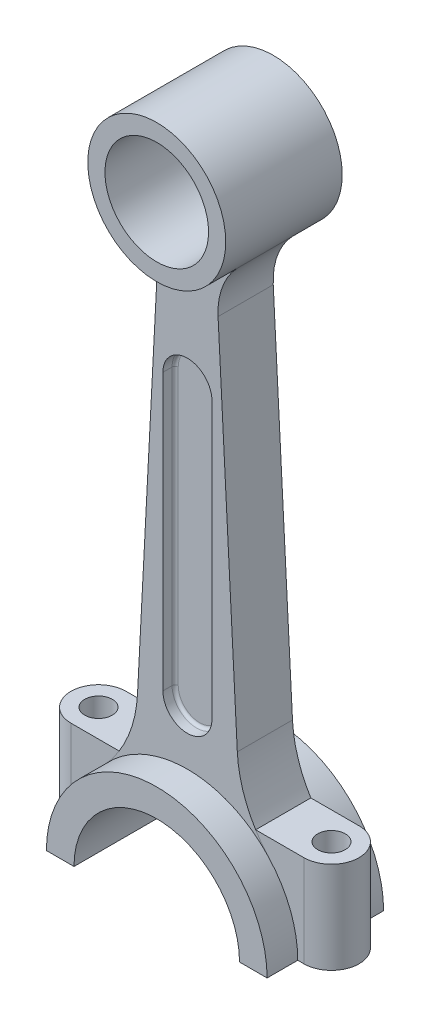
ISO-10303-21;
HEADER;
FILE_DESCRIPTION(('STEP AP214'),'2;1');
FILE_NAME('part.step','',(''),(''),'','','');
FILE_SCHEMA(('AUTOMOTIVE_DESIGN { 1 0 10303 214 1 1 1 1 }'));
ENDSEC;
DATA;
#1=APPLICATION_CONTEXT('core data for automotive mechanical design processes');
#2=APPLICATION_PROTOCOL_DEFINITION('international standard','automotive_design',2000,#1);
#3=PRODUCT_CONTEXT('',#1,'mechanical');
#4=PRODUCT('Part','Part','',(#3));
#5=PRODUCT_RELATED_PRODUCT_CATEGORY('part','',(#4));
#6=PRODUCT_DEFINITION_FORMATION('','',#4);
#7=PRODUCT_DEFINITION_CONTEXT('part definition',#1,'design');
#8=PRODUCT_DEFINITION('design','',#6,#7);
#9=PRODUCT_DEFINITION_SHAPE('','',#8);
#10=(LENGTH_UNIT() NAMED_UNIT(*) SI_UNIT(.MILLI.,.METRE.));
#11=(NAMED_UNIT(*) PLANE_ANGLE_UNIT() SI_UNIT($,.RADIAN.));
#12=(NAMED_UNIT(*) SI_UNIT($,.STERADIAN.) SOLID_ANGLE_UNIT());
#13=UNCERTAINTY_MEASURE_WITH_UNIT(LENGTH_MEASURE(1.E-05),#10,'distance_accuracy_value','');
#14=(GEOMETRIC_REPRESENTATION_CONTEXT(3) GLOBAL_UNCERTAINTY_ASSIGNED_CONTEXT((#13)) GLOBAL_UNIT_ASSIGNED_CONTEXT((#10,
#11,#12)) REPRESENTATION_CONTEXT('',''));
#15=CARTESIAN_POINT('',(0.,0.,0.));
#16=DIRECTION('',(0.,0.,1.));
#17=DIRECTION('',(1.,0.,0.));
#18=AXIS2_PLACEMENT_3D('',#15,#16,#17);
#19=CARTESIAN_POINT('',(-56.2249213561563,-150.065612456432,9.));
#20=DIRECTION('',(0.,0.,-1.));
#21=DIRECTION('',(-1.,0.,0.));
#22=AXIS2_PLACEMENT_3D('',#19,#20,#21);
#23=PLANE('',#22);
#24=CARTESIAN_POINT('',(16.2797399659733,-152.15905070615,8.99815124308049));
#25=CARTESIAN_POINT('',(16.6421278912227,-159.073824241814,8.99815124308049));
#26=CARTESIAN_POINT('',(19.3079660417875,-165.464911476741,8.99815124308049));
#27=CARTESIAN_POINT('',(21.9736081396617,-171.855528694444,8.99815124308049));
#28=CARTESIAN_POINT('',(26.6327739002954,-176.97852402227,8.99815124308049));
#29=B_SPLINE_CURVE_WITH_KNOTS('',2,(#24,#25,#26,#27,#28),.UNSPECIFIED.,.F.,.F.,(3,2,3),(0.,0.5,
1.),.UNSPECIFIED.);
#30=CARTESIAN_POINT('',(22.262894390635,-171.199152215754,8.99951404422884));
#31=VERTEX_POINT('',#30);
#32=CARTESIAN_POINT('',(26.5596134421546,-176.898034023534,8.99911492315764));
#33=VERTEX_POINT('',#32);
#34=EDGE_CURVE('E432',#31,#33,#29,.T.);
#35=ORIENTED_EDGE('',*,*,#34,.F.);
#36=CARTESIAN_POINT('',(56.2249213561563,-150.065612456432,9.));
#37=DIRECTION('',(0.,0.,1.));
#38=DIRECTION('',(1.,0.,0.));
#39=AXIS2_PLACEMENT_3D('',#36,#37,#38);
#40=CIRCLE('',#39,40.);
#41=CARTESIAN_POINT('',(16.2797399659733,-152.15905070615,9.));
#42=VERTEX_POINT('',#41);
#43=EDGE_CURVE('E801',#42,#31,#40,.T.);
#44=ORIENTED_EDGE('',*,*,#43,.F.);
#45=DIRECTION('',(0.0523359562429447,-0.998629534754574,0.));
#46=VECTOR('',#45,1.);
#47=CARTESIAN_POINT('',(10.,-32.3344740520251,9.));
#48=LINE('',#47,#46);
#49=CARTESIAN_POINT('',(10.,-32.3344740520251,9.));
#50=VERTEX_POINT('',#49);
#51=EDGE_CURVE('E802',#50,#42,#48,.T.);
#52=ORIENTED_EDGE('',*,*,#51,.F.);
#53=CARTESIAN_POINT('',(32.4691645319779,-31.1569150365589,9.));
#54=DIRECTION('',(0.,0.,-1.));
#55=DIRECTION('',(-1.,0.,0.));
#56=AXIS2_PLACEMENT_3D('',#53,#54,#55);
#57=CIRCLE('',#56,22.5);
#58=CARTESIAN_POINT('',(16.234582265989,-15.5784575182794,9.));
#59=VERTEX_POINT('',#58);
#60=EDGE_CURVE('E825',#50,#59,#57,.T.);
#61=ORIENTED_EDGE('',*,*,#60,.T.);
#62=CARTESIAN_POINT('',(0.,0.,9.));
#63=DIRECTION('',(0.,0.,1.));
#64=DIRECTION('',(1.,0.,0.));
#65=AXIS2_PLACEMENT_3D('',#62,#63,#64);
#66=CIRCLE('',#65,22.5);
#67=CARTESIAN_POINT('',(-16.234582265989,-15.5784575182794,9.));
#68=VERTEX_POINT('',#67);
#69=EDGE_CURVE('E822',#68,#59,#66,.T.);
#70=ORIENTED_EDGE('',*,*,#69,.F.);
#71=CARTESIAN_POINT('',(-32.4691645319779,-31.1569150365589,9.));
#72=DIRECTION('',(0.,0.,1.));
#73=DIRECTION('',(1.,0.,0.));
#74=AXIS2_PLACEMENT_3D('',#71,#72,#73);
#75=CIRCLE('',#74,22.5);
#76=CARTESIAN_POINT('',(-10.,-32.3344740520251,9.));
#77=VERTEX_POINT('',#76);
#78=EDGE_CURVE('E830',#77,#68,#75,.T.);
#79=ORIENTED_EDGE('',*,*,#78,.F.);
#80=DIRECTION('',(-0.0523359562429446,-0.998629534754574,0.));
#81=VECTOR('',#80,1.);
#82=CARTESIAN_POINT('',(-10.,-32.3344740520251,9.));
#83=LINE('',#82,#81);
#84=CARTESIAN_POINT('',(-16.2797399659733,-152.15905070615,9.));
#85=VERTEX_POINT('',#84);
#86=EDGE_CURVE('E806',#77,#85,#83,.T.);
#87=ORIENTED_EDGE('',*,*,#86,.T.);
#88=CARTESIAN_POINT('',(-56.2249213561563,-150.065612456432,9.));
#89=DIRECTION('',(0.,0.,-1.));
#90=DIRECTION('',(-1.,0.,0.));
#91=AXIS2_PLACEMENT_3D('',#88,#89,#90);
#92=CIRCLE('',#91,40.);
#93=CARTESIAN_POINT('',(-22.2628943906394,-171.199152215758,8.99951404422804));
#94=VERTEX_POINT('',#93);
#95=EDGE_CURVE('E808',#85,#94,#92,.T.);
#96=ORIENTED_EDGE('',*,*,#95,.T.);
#97=CARTESIAN_POINT('',(-22.2633802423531,-171.19884990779,9.));
#98=CARTESIAN_POINT('',(-24.1542025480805,-174.237439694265,9.));
#99=CARTESIAN_POINT('',(-26.5544088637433,-176.892104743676,9.));
#100=B_SPLINE_CURVE_WITH_KNOTS('',2,(#97,#98,#99),.UNSPECIFIED.,.F.,.F.,(3,3),(0.,1.),.UNSPECIFIED.);
#101=CARTESIAN_POINT('',(-26.5542756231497,-176.892226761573,8.9991654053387));
#102=VERTEX_POINT('',#101);
#103=EDGE_CURVE('E724',#94,#102,#100,.T.);
#104=ORIENTED_EDGE('',*,*,#103,.T.);
#105=CARTESIAN_POINT('',(-26.6327739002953,-176.97852402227,9.));
#106=CARTESIAN_POINT('',(-24.102491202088,-174.196346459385,9.));
#107=CARTESIAN_POINT('',(-21.0512266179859,-171.996739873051,9.));
#108=CARTESIAN_POINT('',(-18.0008713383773,-169.797788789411,9.));
#109=CARTESIAN_POINT('',(-14.5605049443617,-168.276205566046,9.));
#110=CARTESIAN_POINT('',(-11.1215103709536,-166.755229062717,9.));
#111=CARTESIAN_POINT('',(-7.44093448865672,-165.977606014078,9.));
#112=CARTESIAN_POINT('',(-3.76182620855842,-165.200293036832,9.));
#113=CARTESIAN_POINT('',(0.,-165.200214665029,9.));
#114=CARTESIAN_POINT('',(3.76032620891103,-165.200136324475,9.));
#115=CARTESIAN_POINT('',(7.44093448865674,-165.977606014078,9.));
#116=CARTESIAN_POINT('',(11.1200751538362,-166.754765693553,9.));
#117=CARTESIAN_POINT('',(14.5605049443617,-168.276205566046,9.));
#118=CARTESIAN_POINT('',(17.9995628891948,-169.79703877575,9.));
#119=CARTESIAN_POINT('',(21.0512266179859,-171.996739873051,9.));
#120=CARTESIAN_POINT('',(24.1019810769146,-174.195785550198,9.));
#121=CARTESIAN_POINT('',(26.6327739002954,-176.97852402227,9.));
#122=B_SPLINE_CURVE_WITH_KNOTS('',2,(#105,#106,#107,#108,#109,#110,#111,#112,#113,#114,#115,
#116,#117,#118,#119,#120,#121),.UNSPECIFIED.,.F.,.F.,(3,2,2,2,2,2,2,2,3),(0.,0.125,0.25,0.375,
0.5,0.625,0.75,0.875,1.),.UNSPECIFIED.);
#123=EDGE_CURVE('E812',#102,#33,#122,.T.);
#124=ORIENTED_EDGE('',*,*,#123,.T.);
#125=EDGE_LOOP('',(#35,#44,#52,#61,#70,#79,#87,#96,#104,#124));
#126=FACE_BOUND('',#125,.T.);
#127=CARTESIAN_POINT('',(0.,-57.0793539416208,9.));
#128=DIRECTION('',(0.,0.,-1.));
#129=DIRECTION('',(-1.,0.,0.));
#130=AXIS2_PLACEMENT_3D('',#127,#128,#129);
#131=CIRCLE('',#130,8.);
#132=CARTESIAN_POINT('',(8.,-57.0793539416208,9.));
#133=VERTEX_POINT('',#132);
#134=CARTESIAN_POINT('',(-8.,-57.0793539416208,9.));
#135=VERTEX_POINT('',#134);
#136=EDGE_CURVE('E284',#133,#135,#131,.F.);
#137=ORIENTED_EDGE('',*,*,#136,.F.);
#138=DIRECTION('',(0.,1.,0.));
#139=VECTOR('',#138,1.);
#140=CARTESIAN_POINT('',(7.99999999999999,-150.065612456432,9.));
#141=LINE('',#140,#139);
#142=CARTESIAN_POINT('',(7.99999999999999,-147.079353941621,9.));
#143=VERTEX_POINT('',#142);
#144=EDGE_CURVE('E375',#143,#133,#141,.T.);
#145=ORIENTED_EDGE('',*,*,#144,.F.);
#146=CARTESIAN_POINT('',(0.,-147.079353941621,9.));
#147=DIRECTION('',(0.,0.,-1.));
#148=DIRECTION('',(-1.,0.,0.));
#149=AXIS2_PLACEMENT_3D('',#146,#147,#148);
#150=CIRCLE('',#149,8.);
#151=CARTESIAN_POINT('',(-8.,-147.079353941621,9.));
#152=VERTEX_POINT('',#151);
#153=EDGE_CURVE('E486',#152,#143,#150,.F.);
#154=ORIENTED_EDGE('',*,*,#153,.F.);
#155=DIRECTION('',(0.,-1.,0.));
#156=VECTOR('',#155,1.);
#157=CARTESIAN_POINT('',(-8.,-150.065612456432,9.));
#158=LINE('',#157,#156);
#159=EDGE_CURVE('E495',#135,#152,#158,.T.);
#160=ORIENTED_EDGE('',*,*,#159,.F.);
#161=EDGE_LOOP('',(#137,#145,#154,#160));
#162=FACE_BOUND('',#161,.T.);
#163=ADVANCED_FACE('F50',(#126,#162),#23,.F.);
#164=CARTESIAN_POINT('',(-20.9981735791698,-202.829751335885,-8.99815124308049));
#165=DIRECTION('',(0.,0.,1.));
#166=DIRECTION('',(1.,0.,0.));
#167=AXIS2_PLACEMENT_3D('',#164,#165,#166);
#168=PLANE('',#167);
#169=DIRECTION('',(1.,0.,0.));
#170=VECTOR('',#169,1.);
#171=CARTESIAN_POINT('',(-20.9981735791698,-201.2,-8.99815124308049));
#172=LINE('',#171,#170);
#173=CARTESIAN_POINT('',(-38.,-201.2,-8.99815124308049));
#174=VERTEX_POINT('',#173);
#175=CARTESIAN_POINT('',(-35.9999783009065,-201.2,-8.99815124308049));
#176=VERTEX_POINT('',#175);
#177=EDGE_CURVE('E526',#174,#176,#172,.T.);
#178=ORIENTED_EDGE('',*,*,#177,.F.);
#179=DIRECTION('',(0.,1.,0.));
#180=VECTOR('',#179,1.);
#181=CARTESIAN_POINT('',(-38.,-202.829751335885,-8.99815124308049));
#182=LINE('',#181,#180);
#183=CARTESIAN_POINT('',(-38.,-171.2,-8.99815124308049));
#184=VERTEX_POINT('',#183);
#185=EDGE_CURVE('E560',#174,#184,#182,.T.);
#186=ORIENTED_EDGE('',*,*,#185,.T.);
#187=DIRECTION('',(1.,0.,0.));
#188=VECTOR('',#187,1.);
#189=CARTESIAN_POINT('',(-20.9981735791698,-171.2,-8.99815124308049));
#190=LINE('',#189,#188);
#191=CARTESIAN_POINT('',(-22.2628943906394,-171.199152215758,-8.99951404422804));
#192=VERTEX_POINT('',#191);
#193=EDGE_CURVE('E559',#184,#192,#190,.T.);
#194=ORIENTED_EDGE('',*,*,#193,.T.);
#195=CARTESIAN_POINT('',(-16.2797399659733,-152.15905070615,-8.99815124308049));
#196=CARTESIAN_POINT('',(-16.6421278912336,-159.073824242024,-8.99815124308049));
#197=CARTESIAN_POINT('',(-19.3079660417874,-165.464911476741,-8.99815124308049));
#198=CARTESIAN_POINT('',(-21.9736081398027,-171.855528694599,-8.99815124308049));
#199=CARTESIAN_POINT('',(-26.6327739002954,-176.97852402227,-8.99815124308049));
#200=B_SPLINE_CURVE_WITH_KNOTS('',2,(#195,#196,#197,#198,#199),.UNSPECIFIED.,.F.,.F.,(3,2,3),
(0.,0.5,1.),.UNSPECIFIED.);
#201=CARTESIAN_POINT('',(-26.559583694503,-176.89806123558,-8.99915367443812));
#202=VERTEX_POINT('',#201);
#203=EDGE_CURVE('E450',#192,#202,#200,.T.);
#204=ORIENTED_EDGE('',*,*,#203,.T.);
#205=CARTESIAN_POINT('',(0.,-201.2,-9.));
#206=DIRECTION('',(0.,0.,-1.));
#207=DIRECTION('',(-0.739803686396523,0.672822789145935,0.));
#208=AXIS2_PLACEMENT_3D('',#205,#206,#207);
#209=CIRCLE('',#208,35.9997853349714);
#210=CARTESIAN_POINT('',(-26.6308913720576,-176.976252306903,-8.99815124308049));
#211=VERTEX_POINT('',#210);
#212=EDGE_CURVE('E625',#211,#202,#209,.T.);
#213=ORIENTED_EDGE('',*,*,#212,.F.);
#214=CARTESIAN_POINT('',(0.,-201.2,-8.99815124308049));
#215=DIRECTION('',(0.,0.,-1.));
#216=DIRECTION('',(-1.,0.,0.));
#217=AXIS2_PLACEMENT_3D('',#214,#215,#216);
#218=CIRCLE('',#217,35.9997853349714);
#219=EDGE_CURVE('E755',#176,#211,#218,.T.);
#220=ORIENTED_EDGE('',*,*,#219,.F.);
#221=EDGE_LOOP('',(#178,#186,#194,#204,#213,#220));
#222=FACE_BOUND('',#221,.T.);
#223=ADVANCED_FACE('F395',(#222),#168,.F.);
#224=CARTESIAN_POINT('',(-38.,-202.829751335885,0.));
#225=DIRECTION('',(0.,1.,0.));
#226=DIRECTION('',(0.,0.,1.));
#227=AXIS2_PLACEMENT_3D('',#224,#225,#226);
#228=CYLINDRICAL_SURFACE('',#227,4.5);
#229=CARTESIAN_POINT('',(-38.,-171.2,0.));
#230=DIRECTION('',(0.,-1.,0.));
#231=DIRECTION('',(0.,0.,1.));
#232=AXIS2_PLACEMENT_3D('',#229,#230,#231);
#233=CIRCLE('',#232,4.5);
#234=CARTESIAN_POINT('',(-38.,-171.2,4.5));
#235=VERTEX_POINT('',#234);
#236=EDGE_CURVE('E549',#235,#235,#233,.T.);
#237=ORIENTED_EDGE('',*,*,#236,.F.);
#238=EDGE_LOOP('',(#237));
#239=FACE_BOUND('',#238,.T.);
#240=CARTESIAN_POINT('',(-38.,-201.2,0.));
#241=DIRECTION('',(0.,-1.,0.));
#242=DIRECTION('',(0.,0.,-1.));
#243=AXIS2_PLACEMENT_3D('',#240,#241,#242);
#244=CIRCLE('',#243,4.5);
#245=CARTESIAN_POINT('',(-38.,-201.2,-4.5));
#246=VERTEX_POINT('',#245);
#247=EDGE_CURVE('E535',#246,#246,#244,.T.);
#248=ORIENTED_EDGE('',*,*,#247,.T.);
#249=EDGE_LOOP('',(#248));
#250=FACE_BOUND('',#249,.T.);
#251=ADVANCED_FACE('F396',(#239,#250),#228,.F.);
#252=CARTESIAN_POINT('',(-38.,-202.829751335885,0.));
#253=DIRECTION('',(0.,1.,0.));
#254=DIRECTION('',(0.,0.,1.));
#255=AXIS2_PLACEMENT_3D('',#252,#253,#254);
#256=CYLINDRICAL_SURFACE('',#255,8.99815124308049);
#257=CARTESIAN_POINT('',(-38.,-201.2,0.));
#258=DIRECTION('',(0.,-1.,0.));
#259=DIRECTION('',(0.,0.,-1.));
#260=AXIS2_PLACEMENT_3D('',#257,#258,#259);
#261=CIRCLE('',#260,8.99815124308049);
#262=CARTESIAN_POINT('',(-38.,-201.2,8.99815124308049));
#263=VERTEX_POINT('',#262);
#264=EDGE_CURVE('E527',#263,#174,#261,.T.);
#265=ORIENTED_EDGE('',*,*,#264,.F.);
#266=DIRECTION('',(0.,1.,0.));
#267=VECTOR('',#266,1.);
#268=CARTESIAN_POINT('',(-38.,-202.829751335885,8.99815124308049));
#269=LINE('',#268,#267);
#270=CARTESIAN_POINT('',(-38.,-171.2,8.99815124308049));
#271=VERTEX_POINT('',#270);
#272=EDGE_CURVE('E554',#263,#271,#269,.T.);
#273=ORIENTED_EDGE('',*,*,#272,.T.);
#274=CARTESIAN_POINT('',(-38.,-171.2,0.));
#275=DIRECTION('',(0.,-1.,0.));
#276=DIRECTION('',(0.,0.,-1.));
#277=AXIS2_PLACEMENT_3D('',#274,#275,#276);
#278=CIRCLE('',#277,8.99815124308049);
#279=EDGE_CURVE('E552',#271,#184,#278,.T.);
#280=ORIENTED_EDGE('',*,*,#279,.T.);
#281=ORIENTED_EDGE('',*,*,#185,.F.);
#282=EDGE_LOOP('',(#265,#273,#280,#281));
#283=FACE_BOUND('',#282,.T.);
#284=ADVANCED_FACE('F780',(#283),#256,.T.);
#285=CARTESIAN_POINT('',(-38.,-202.829751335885,8.99815124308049));
#286=DIRECTION('',(0.,0.,-1.));
#287=DIRECTION('',(-1.,0.,0.));
#288=AXIS2_PLACEMENT_3D('',#285,#286,#287);
#289=PLANE('',#288);
#290=DIRECTION('',(-1.,0.,0.));
#291=VECTOR('',#290,1.);
#292=CARTESIAN_POINT('',(-38.,-201.2,8.99815124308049));
#293=LINE('',#292,#291);
#294=CARTESIAN_POINT('',(-35.9998792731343,-201.200000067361,8.99815124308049));
#295=VERTEX_POINT('',#294);
#296=EDGE_CURVE('E525',#295,#263,#293,.T.);
#297=ORIENTED_EDGE('',*,*,#296,.F.);
#298=CARTESIAN_POINT('',(0.,-201.2,8.99815124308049));
#299=DIRECTION('',(0.,0.,1.));
#300=DIRECTION('',(-0.73980368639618,0.672822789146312,0.));
#301=AXIS2_PLACEMENT_3D('',#298,#299,#300);
#302=CIRCLE('',#301,35.9997853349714);
#303=CARTESIAN_POINT('',(-26.6307844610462,-176.976103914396,8.99815124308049));
#304=VERTEX_POINT('',#303);
#305=EDGE_CURVE('E540',#304,#295,#302,.T.);
#306=ORIENTED_EDGE('',*,*,#305,.F.);
#307=CARTESIAN_POINT('',(-35.9628760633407,-202.829751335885,8.99815124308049));
#308=CARTESIAN_POINT('',(-36.1662621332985,-198.341736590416,8.99815124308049));
#309=CARTESIAN_POINT('',(-35.2602665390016,-193.940651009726,8.99815124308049));
#310=CARTESIAN_POINT('',(-34.3544966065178,-189.540661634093,8.99815124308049));
#311=CARTESIAN_POINT('',(-32.3944093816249,-185.496917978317,8.99815124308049));
#312=CARTESIAN_POINT('',(-30.434976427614,-181.454524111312,8.99815124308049));
#313=CARTESIAN_POINT('',(-27.5411273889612,-178.016582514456,8.99815124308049));
#314=CARTESIAN_POINT('',(-24.6479990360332,-174.579497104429,8.99815124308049));
#315=CARTESIAN_POINT('',(-20.9981735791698,-171.958569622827,8.99815124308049));
#316=B_SPLINE_CURVE_WITH_KNOTS('',2,(#307,#308,#309,#310,#311,#312,#313,#314,#315),
.UNSPECIFIED.,.F.,.F.,(3,2,2,2,3),(0.,0.25,0.5,0.75,1.),.UNSPECIFIED.);
#317=EDGE_CURVE('E807',#304,#102,#316,.T.);
#318=ORIENTED_EDGE('',*,*,#317,.T.);
#319=ORIENTED_EDGE('',*,*,#103,.F.);
#320=DIRECTION('',(-1.,0.,0.));
#321=VECTOR('',#320,1.);
#322=CARTESIAN_POINT('',(-38.,-171.2,8.99815124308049));
#323=LINE('',#322,#321);
#324=EDGE_CURVE('E741',#94,#271,#323,.T.);
#325=ORIENTED_EDGE('',*,*,#324,.T.);
#326=ORIENTED_EDGE('',*,*,#272,.F.);
#327=EDGE_LOOP('',(#297,#306,#318,#319,#325,#326));
#328=FACE_BOUND('',#327,.T.);
#329=ADVANCED_FACE('F767',(#328),#289,.F.);
#330=CARTESIAN_POINT('',(20.9981735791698,-202.829751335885,-8.99815124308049));
#331=DIRECTION('',(0.,0.,1.));
#332=DIRECTION('',(1.,0.,0.));
#333=AXIS2_PLACEMENT_3D('',#330,#331,#332);
#334=PLANE('',#333);
#335=DIRECTION('',(1.,0.,0.));
#336=VECTOR('',#335,1.);
#337=CARTESIAN_POINT('',(20.9981735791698,-201.2,-8.99815124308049));
#338=LINE('',#337,#336);
#339=CARTESIAN_POINT('',(35.9998792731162,-201.200000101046,-8.99815124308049));
#340=VERTEX_POINT('',#339);
#341=CARTESIAN_POINT('',(38.,-201.2,-8.99815124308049));
#342=VERTEX_POINT('',#341);
#343=EDGE_CURVE('E511',#340,#342,#338,.T.);
#344=ORIENTED_EDGE('',*,*,#343,.F.);
#345=CARTESIAN_POINT('',(0.,-201.2,-8.99815124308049));
#346=DIRECTION('',(0.,0.,-1.));
#347=DIRECTION('',(0.73980368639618,0.672822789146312,0.));
#348=AXIS2_PLACEMENT_3D('',#345,#346,#347);
#349=CIRCLE('',#348,35.9997853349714);
#350=CARTESIAN_POINT('',(26.6307844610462,-176.976103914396,-8.99815124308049));
#351=VERTEX_POINT('',#350);
#352=EDGE_CURVE('E796',#351,#340,#349,.T.);
#353=ORIENTED_EDGE('',*,*,#352,.F.);
#354=CARTESIAN_POINT('',(0.,-201.2,-9.));
#355=DIRECTION('',(0.,0.,-1.));
#356=DIRECTION('',(0.737619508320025,0.675216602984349,0.));
#357=AXIS2_PLACEMENT_3D('',#354,#355,#356);
#358=CIRCLE('',#357,35.9997853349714);
#359=CARTESIAN_POINT('',(26.5543100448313,-176.8921952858,-8.99912082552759));
#360=VERTEX_POINT('',#359);
#361=EDGE_CURVE('E630',#360,#351,#358,.T.);
#362=ORIENTED_EDGE('',*,*,#361,.F.);
#363=CARTESIAN_POINT('',(22.26338024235,-171.198849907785,-9.));
#364=CARTESIAN_POINT('',(24.1542025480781,-174.237439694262,-9.));
#365=CARTESIAN_POINT('',(26.554408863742,-176.892104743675,-9.));
#366=B_SPLINE_CURVE_WITH_KNOTS('',2,(#363,#364,#365),.UNSPECIFIED.,.F.,.F.,(3,3),(0.,1.),.UNSPECIFIED.);
#367=CARTESIAN_POINT('',(22.262894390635,-171.199152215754,-8.99951404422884));
#368=VERTEX_POINT('',#367);
#369=EDGE_CURVE('E708',#368,#360,#366,.T.);
#370=ORIENTED_EDGE('',*,*,#369,.F.);
#371=DIRECTION('',(1.,0.,0.));
#372=VECTOR('',#371,1.);
#373=CARTESIAN_POINT('',(20.9981735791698,-171.2,-8.99815124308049));
#374=LINE('',#373,#372);
#375=CARTESIAN_POINT('',(38.,-171.2,-8.99815124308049));
#376=VERTEX_POINT('',#375);
#377=EDGE_CURVE('E726',#368,#376,#374,.T.);
#378=ORIENTED_EDGE('',*,*,#377,.T.);
#379=DIRECTION('',(0.,1.,0.));
#380=VECTOR('',#379,1.);
#381=CARTESIAN_POINT('',(38.,-202.829751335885,-8.99815124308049));
#382=LINE('',#381,#380);
#383=EDGE_CURVE('E543',#342,#376,#382,.T.);
#384=ORIENTED_EDGE('',*,*,#383,.F.);
#385=EDGE_LOOP('',(#344,#353,#362,#370,#378,#384));
#386=FACE_BOUND('',#385,.T.);
#387=ADVANCED_FACE('F582',(#386),#334,.F.);
#388=CARTESIAN_POINT('',(38.,-202.829751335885,0.));
#389=DIRECTION('',(0.,1.,0.));
#390=DIRECTION('',(0.,0.,1.));
#391=AXIS2_PLACEMENT_3D('',#388,#389,#390);
#392=CYLINDRICAL_SURFACE('',#391,4.5);
#393=CARTESIAN_POINT('',(38.,-171.2,0.));
#394=DIRECTION('',(0.,-1.,0.));
#395=DIRECTION('',(0.,0.,-1.));
#396=AXIS2_PLACEMENT_3D('',#393,#394,#395);
#397=CIRCLE('',#396,4.5);
#398=CARTESIAN_POINT('',(38.,-171.2,-4.5));
#399=VERTEX_POINT('',#398);
#400=EDGE_CURVE('E547',#399,#399,#397,.T.);
#401=ORIENTED_EDGE('',*,*,#400,.F.);
#402=EDGE_LOOP('',(#401));
#403=FACE_BOUND('',#402,.T.);
#404=CARTESIAN_POINT('',(38.,-201.2,0.));
#405=DIRECTION('',(0.,-1.,0.));
#406=DIRECTION('',(0.,0.,-1.));
#407=AXIS2_PLACEMENT_3D('',#404,#405,#406);
#408=CIRCLE('',#407,4.5);
#409=CARTESIAN_POINT('',(38.,-201.2,-4.5));
#410=VERTEX_POINT('',#409);
#411=EDGE_CURVE('E512',#410,#410,#408,.T.);
#412=ORIENTED_EDGE('',*,*,#411,.T.);
#413=EDGE_LOOP('',(#412));
#414=FACE_BOUND('',#413,.T.);
#415=ADVANCED_FACE('F1053',(#403,#414),#392,.F.);
#416=CARTESIAN_POINT('',(38.,-202.829751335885,0.));
#417=DIRECTION('',(0.,1.,0.));
#418=DIRECTION('',(0.,0.,1.));
#419=AXIS2_PLACEMENT_3D('',#416,#417,#418);
#420=CYLINDRICAL_SURFACE('',#419,8.99815124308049);
#421=CARTESIAN_POINT('',(38.,-201.2,0.));
#422=DIRECTION('',(0.,-1.,0.));
#423=DIRECTION('',(0.,0.,-1.));
#424=AXIS2_PLACEMENT_3D('',#421,#422,#423);
#425=CIRCLE('',#424,8.99815124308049);
#426=CARTESIAN_POINT('',(38.,-201.2,8.99815124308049));
#427=VERTEX_POINT('',#426);
#428=EDGE_CURVE('E517',#342,#427,#425,.T.);
#429=ORIENTED_EDGE('',*,*,#428,.F.);
#430=ORIENTED_EDGE('',*,*,#383,.T.);
#431=CARTESIAN_POINT('',(38.,-171.2,0.));
#432=DIRECTION('',(0.,-1.,0.));
#433=DIRECTION('',(0.,0.,1.));
#434=AXIS2_PLACEMENT_3D('',#431,#432,#433);
#435=CIRCLE('',#434,8.99815124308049);
#436=CARTESIAN_POINT('',(38.,-171.2,8.99815124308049));
#437=VERTEX_POINT('',#436);
#438=EDGE_CURVE('E541',#376,#437,#435,.T.);
#439=ORIENTED_EDGE('',*,*,#438,.T.);
#440=DIRECTION('',(0.,1.,0.));
#441=VECTOR('',#440,1.);
#442=CARTESIAN_POINT('',(38.,-202.829751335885,8.99815124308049));
#443=LINE('',#442,#441);
#444=EDGE_CURVE('E539',#427,#437,#443,.T.);
#445=ORIENTED_EDGE('',*,*,#444,.F.);
#446=EDGE_LOOP('',(#429,#430,#439,#445));
#447=FACE_BOUND('',#446,.T.);
#448=ADVANCED_FACE('F576',(#447),#420,.T.);
#449=CARTESIAN_POINT('',(38.,-202.829751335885,8.99815124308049));
#450=DIRECTION('',(0.,0.,-1.));
#451=DIRECTION('',(-1.,0.,0.));
#452=AXIS2_PLACEMENT_3D('',#449,#450,#451);
#453=PLANE('',#452);
#454=DIRECTION('',(-1.,0.,0.));
#455=VECTOR('',#454,1.);
#456=CARTESIAN_POINT('',(38.,-201.2,8.99815124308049));
#457=LINE('',#456,#455);
#458=CARTESIAN_POINT('',(35.9998818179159,-201.200000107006,8.99815124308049));
#459=VERTEX_POINT('',#458);
#460=EDGE_CURVE('E518',#427,#459,#457,.T.);
#461=ORIENTED_EDGE('',*,*,#460,.F.);
#462=ORIENTED_EDGE('',*,*,#444,.T.);
#463=DIRECTION('',(-1.,0.,0.));
#464=VECTOR('',#463,1.);
#465=CARTESIAN_POINT('',(38.,-171.2,8.99815124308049));
#466=LINE('',#465,#464);
#467=EDGE_CURVE('E538',#437,#31,#466,.T.);
#468=ORIENTED_EDGE('',*,*,#467,.T.);
#469=ORIENTED_EDGE('',*,*,#34,.T.);
#470=CARTESIAN_POINT('',(20.9981735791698,-171.958569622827,8.99815124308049));
#471=CARTESIAN_POINT('',(24.6473803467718,-174.579052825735,8.99815124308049));
#472=CARTESIAN_POINT('',(27.5411273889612,-178.016582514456,8.99815124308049));
#473=CARTESIAN_POINT('',(30.4341536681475,-181.453255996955,8.99815124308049));
#474=CARTESIAN_POINT('',(32.3944093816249,-185.496917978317,8.99815124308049));
#475=CARTESIAN_POINT('',(34.3540107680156,-189.539230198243,8.99815124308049));
#476=CARTESIAN_POINT('',(35.2602665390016,-193.940651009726,8.99815124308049));
#477=CARTESIAN_POINT('',(36.1662966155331,-198.340975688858,8.99815124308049));
#478=CARTESIAN_POINT('',(35.9628760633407,-202.829751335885,8.99815124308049));
#479=B_SPLINE_CURVE_WITH_KNOTS('',2,(#470,#471,#472,#473,#474,#475,#476,#477,#478),
.UNSPECIFIED.,.F.,.F.,(3,2,2,2,3),(0.,0.25,0.5,0.75,1.),.UNSPECIFIED.);
#480=CARTESIAN_POINT('',(26.6308913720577,-176.976252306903,8.99815124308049));
#481=VERTEX_POINT('',#480);
#482=EDGE_CURVE('E809',#33,#481,#479,.T.);
#483=ORIENTED_EDGE('',*,*,#482,.T.);
#484=CARTESIAN_POINT('',(0.,-201.2,8.99815124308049));
#485=DIRECTION('',(0.,0.,1.));
#486=DIRECTION('',(1.,0.,0.));
#487=AXIS2_PLACEMENT_3D('',#484,#485,#486);
#488=CIRCLE('',#487,35.9997853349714);
#489=EDGE_CURVE('E490',#459,#481,#488,.T.);
#490=ORIENTED_EDGE('',*,*,#489,.F.);
#491=EDGE_LOOP('',(#461,#462,#468,#469,#483,#490));
#492=FACE_BOUND('',#491,.T.);
#493=ADVANCED_FACE('F569',(#492),#453,.F.);
#494=CARTESIAN_POINT('',(-56.2249213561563,-150.065612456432,9.));
#495=DIRECTION('',(0.,0.,-1.));
#496=DIRECTION('',(-1.,0.,0.));
#497=AXIS2_PLACEMENT_3D('',#494,#495,#496);
#498=CYLINDRICAL_SURFACE('',#497,40.);
#499=DIRECTION('',(0.,0.,-1.));
#500=VECTOR('',#499,1.);
#501=CARTESIAN_POINT('',(-22.264095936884,-171.2,9.));
#502=LINE('',#501,#500);
#503=EDGE_CURVE('E595',#94,#192,#502,.T.);
#504=ORIENTED_EDGE('',*,*,#503,.F.);
#505=ORIENTED_EDGE('',*,*,#95,.F.);
#506=DIRECTION('',(0.,0.,-1.));
#507=VECTOR('',#506,1.);
#508=CARTESIAN_POINT('',(-16.2797399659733,-152.15905070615,9.));
#509=LINE('',#508,#507);
#510=CARTESIAN_POINT('',(-16.2797399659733,-152.15905070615,-9.));
#511=VERTEX_POINT('',#510);
#512=EDGE_CURVE('E849',#85,#511,#509,.T.);
#513=ORIENTED_EDGE('',*,*,#512,.T.);
#514=CARTESIAN_POINT('',(-56.2249213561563,-150.065612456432,-9.));
#515=DIRECTION('',(0.,0.,-1.));
#516=DIRECTION('',(-1.,0.,0.));
#517=AXIS2_PLACEMENT_3D('',#514,#515,#516);
#518=CIRCLE('',#517,40.);
#519=EDGE_CURVE('E622',#511,#192,#518,.T.);
#520=ORIENTED_EDGE('',*,*,#519,.T.);
#521=EDGE_LOOP('',(#504,#505,#513,#520));
#522=FACE_BOUND('',#521,.T.);
#523=ADVANCED_FACE('F579',(#522),#498,.F.);
#524=CARTESIAN_POINT('',(-56.2249213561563,-150.065612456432,-9.));
#525=DIRECTION('',(0.,0.,-1.));
#526=DIRECTION('',(-1.,0.,0.));
#527=AXIS2_PLACEMENT_3D('',#524,#525,#526);
#528=PLANE('',#527);
#529=CARTESIAN_POINT('',(0.,-57.0793539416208,-9.));
#530=DIRECTION('',(0.,0.,-1.));
#531=DIRECTION('',(-1.,0.,0.));
#532=AXIS2_PLACEMENT_3D('',#529,#530,#531);
#533=CIRCLE('',#532,8.);
#534=CARTESIAN_POINT('',(-8.,-57.0793539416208,-9.));
#535=VERTEX_POINT('',#534);
#536=CARTESIAN_POINT('',(8.,-57.0793539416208,-9.));
#537=VERTEX_POINT('',#536);
#538=EDGE_CURVE('E289',#535,#537,#533,.T.);
#539=ORIENTED_EDGE('',*,*,#538,.F.);
#540=DIRECTION('',(0.,1.,0.));
#541=VECTOR('',#540,1.);
#542=CARTESIAN_POINT('',(-8.,-150.065612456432,-9.));
#543=LINE('',#542,#541);
#544=CARTESIAN_POINT('',(-8.,-147.079353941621,-9.));
#545=VERTEX_POINT('',#544);
#546=EDGE_CURVE('E275',#545,#535,#543,.T.);
#547=ORIENTED_EDGE('',*,*,#546,.F.);
#548=CARTESIAN_POINT('',(0.,-147.079353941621,-9.));
#549=DIRECTION('',(0.,0.,-1.));
#550=DIRECTION('',(-1.,0.,0.));
#551=AXIS2_PLACEMENT_3D('',#548,#549,#550);
#552=CIRCLE('',#551,8.);
#553=CARTESIAN_POINT('',(8.,-147.079353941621,-9.));
#554=VERTEX_POINT('',#553);
#555=EDGE_CURVE('E281',#554,#545,#552,.T.);
#556=ORIENTED_EDGE('',*,*,#555,.F.);
#557=DIRECTION('',(0.,-1.,0.));
#558=VECTOR('',#557,1.);
#559=CARTESIAN_POINT('',(7.99999999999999,-150.065612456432,-9.));
#560=LINE('',#559,#558);
#561=EDGE_CURVE('E300',#537,#554,#560,.T.);
#562=ORIENTED_EDGE('',*,*,#561,.F.);
#563=EDGE_LOOP('',(#539,#547,#556,#562));
#564=FACE_BOUND('',#563,.T.);
#565=ORIENTED_EDGE('',*,*,#369,.T.);
#566=CARTESIAN_POINT('',(0.,-201.2,-9.));
#567=DIRECTION('',(0.,0.,-1.));
#568=DIRECTION('',(-0.737767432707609,0.675054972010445,0.));
#569=AXIS2_PLACEMENT_3D('',#566,#567,#568);
#570=CIRCLE('',#569,35.9997853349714);
#571=EDGE_CURVE('E641',#202,#360,#570,.T.);
#572=ORIENTED_EDGE('',*,*,#571,.F.);
#573=ORIENTED_EDGE('',*,*,#203,.F.);
#574=ORIENTED_EDGE('',*,*,#519,.F.);
#575=DIRECTION('',(-0.0523359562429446,-0.998629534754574,0.));
#576=VECTOR('',#575,1.);
#577=CARTESIAN_POINT('',(-10.,-32.3344740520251,-9.));
#578=LINE('',#577,#576);
#579=CARTESIAN_POINT('',(-10.,-32.3344740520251,-9.));
#580=VERTEX_POINT('',#579);
#581=EDGE_CURVE('E461',#580,#511,#578,.T.);
#582=ORIENTED_EDGE('',*,*,#581,.F.);
#583=CARTESIAN_POINT('',(-32.4691645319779,-31.1569150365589,-9.));
#584=DIRECTION('',(0.,0.,1.));
#585=DIRECTION('',(1.,0.,0.));
#586=AXIS2_PLACEMENT_3D('',#583,#584,#585);
#587=CIRCLE('',#586,22.5);
#588=CARTESIAN_POINT('',(-16.234582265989,-15.5784575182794,-9.));
#589=VERTEX_POINT('',#588);
#590=EDGE_CURVE('E811',#580,#589,#587,.T.);
#591=ORIENTED_EDGE('',*,*,#590,.T.);
#592=CARTESIAN_POINT('',(0.,0.,-9.));
#593=DIRECTION('',(0.,0.,1.));
#594=DIRECTION('',(1.,0.,0.));
#595=AXIS2_PLACEMENT_3D('',#592,#593,#594);
#596=CIRCLE('',#595,22.5);
#597=CARTESIAN_POINT('',(16.234582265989,-15.5784575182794,-9.));
#598=VERTEX_POINT('',#597);
#599=EDGE_CURVE('E820',#589,#598,#596,.T.);
#600=ORIENTED_EDGE('',*,*,#599,.T.);
#601=CARTESIAN_POINT('',(32.4691645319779,-31.1569150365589,-9.));
#602=DIRECTION('',(0.,0.,-1.));
#603=DIRECTION('',(-1.,0.,0.));
#604=AXIS2_PLACEMENT_3D('',#601,#602,#603);
#605=CIRCLE('',#604,22.5);
#606=CARTESIAN_POINT('',(10.,-32.3344740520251,-9.));
#607=VERTEX_POINT('',#606);
#608=EDGE_CURVE('E833',#607,#598,#605,.T.);
#609=ORIENTED_EDGE('',*,*,#608,.F.);
#610=DIRECTION('',(0.0523359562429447,-0.998629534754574,0.));
#611=VECTOR('',#610,1.);
#612=CARTESIAN_POINT('',(10.,-32.3344740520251,-9.));
#613=LINE('',#612,#611);
#614=CARTESIAN_POINT('',(16.2797399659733,-152.15905070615,-9.));
#615=VERTEX_POINT('',#614);
#616=EDGE_CURVE('E623',#607,#615,#613,.T.);
#617=ORIENTED_EDGE('',*,*,#616,.T.);
#618=CARTESIAN_POINT('',(56.2249213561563,-150.065612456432,-9.));
#619=DIRECTION('',(0.,0.,1.));
#620=DIRECTION('',(1.,0.,0.));
#621=AXIS2_PLACEMENT_3D('',#618,#619,#620);
#622=CIRCLE('',#621,40.);
#623=EDGE_CURVE('E616',#615,#368,#622,.T.);
#624=ORIENTED_EDGE('',*,*,#623,.T.);
#625=EDGE_LOOP('',(#565,#572,#573,#574,#582,#591,#600,#609,#617,#624));
#626=FACE_BOUND('',#625,.T.);
#627=ADVANCED_FACE('F294',(#564,#626),#528,.T.);
#628=CARTESIAN_POINT('',(0.,-201.2,19.));
#629=DIRECTION('',(0.,0.,-1.));
#630=DIRECTION('',(-1.,0.,0.));
#631=AXIS2_PLACEMENT_3D('',#628,#629,#630);
#632=CYLINDRICAL_SURFACE('',#631,35.9997853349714);
#633=DIRECTION('',(0.,0.,-1.));
#634=VECTOR('',#633,1.);
#635=CARTESIAN_POINT('',(35.9997853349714,-201.2,19.));
#636=LINE('',#635,#634);
#637=CARTESIAN_POINT('',(35.9997853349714,-201.2,19.));
#638=VERTEX_POINT('',#637);
#639=EDGE_CURVE('E467',#638,#459,#636,.T.);
#640=ORIENTED_EDGE('',*,*,#639,.T.);
#641=ORIENTED_EDGE('',*,*,#489,.T.);
#642=ORIENTED_EDGE('',*,*,#482,.F.);
#643=ORIENTED_EDGE('',*,*,#123,.F.);
#644=ORIENTED_EDGE('',*,*,#317,.F.);
#645=ORIENTED_EDGE('',*,*,#305,.T.);
#646=DIRECTION('',(0.,0.,-1.));
#647=VECTOR('',#646,1.);
#648=CARTESIAN_POINT('',(-35.9997853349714,-201.2,19.));
#649=LINE('',#648,#647);
#650=CARTESIAN_POINT('',(-35.9997853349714,-201.2,19.));
#651=VERTEX_POINT('',#650);
#652=EDGE_CURVE('E615',#651,#295,#649,.T.);
#653=ORIENTED_EDGE('',*,*,#652,.F.);
#654=CARTESIAN_POINT('',(0.,-201.2,19.));
#655=DIRECTION('',(0.,0.,1.));
#656=DIRECTION('',(-1.,0.,0.));
#657=AXIS2_PLACEMENT_3D('',#654,#655,#656);
#658=CIRCLE('',#657,35.9997853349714);
#659=EDGE_CURVE('E470',#638,#651,#658,.T.);
#660=ORIENTED_EDGE('',*,*,#659,.F.);
#661=EDGE_LOOP('',(#640,#641,#642,#643,#644,#645,#653,#660));
#662=FACE_BOUND('',#661,.T.);
#663=ADVANCED_FACE('F664',(#662),#632,.T.);
#664=ORIENTED_EDGE('',*,*,#361,.T.);
#665=ORIENTED_EDGE('',*,*,#352,.T.);
#666=CARTESIAN_POINT('',(35.9997853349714,-201.2,-19.));
#667=VERTEX_POINT('',#666);
#668=EDGE_CURVE('E611',#340,#667,#636,.T.);
#669=ORIENTED_EDGE('',*,*,#668,.T.);
#670=CARTESIAN_POINT('',(0.,-201.2,-19.));
#671=DIRECTION('',(0.,0.,1.));
#672=DIRECTION('',(-1.,0.,0.));
#673=AXIS2_PLACEMENT_3D('',#670,#671,#672);
#674=CIRCLE('',#673,35.9997853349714);
#675=CARTESIAN_POINT('',(-35.9997853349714,-201.2,-19.));
#676=VERTEX_POINT('',#675);
#677=EDGE_CURVE('E471',#667,#676,#674,.T.);
#678=ORIENTED_EDGE('',*,*,#677,.T.);
#679=EDGE_CURVE('E474',#176,#676,#649,.T.);
#680=ORIENTED_EDGE('',*,*,#679,.F.);
#681=ORIENTED_EDGE('',*,*,#219,.T.);
#682=ORIENTED_EDGE('',*,*,#212,.T.);
#683=ORIENTED_EDGE('',*,*,#571,.T.);
#684=EDGE_LOOP('',(#664,#665,#669,#678,#680,#681,#682,#683));
#685=FACE_BOUND('',#684,.T.);
#686=ADVANCED_FACE('F671',(#685),#632,.T.);
#687=CARTESIAN_POINT('',(0.,0.,19.));
#688=DIRECTION('',(0.,0.,-1.));
#689=DIRECTION('',(-1.,0.,0.));
#690=AXIS2_PLACEMENT_3D('',#687,#688,#689);
#691=CYLINDRICAL_SURFACE('',#690,22.5);
#692=CARTESIAN_POINT('',(0.,0.,-19.));
#693=DIRECTION('',(0.,0.,1.));
#694=DIRECTION('',(1.,0.,0.));
#695=AXIS2_PLACEMENT_3D('',#692,#693,#694);
#696=CIRCLE('',#695,22.5);
#697=CARTESIAN_POINT('',(22.5,0.,-19.));
#698=VERTEX_POINT('',#697);
#699=EDGE_CURVE('E857',#698,#698,#696,.T.);
#700=ORIENTED_EDGE('',*,*,#699,.T.);
#701=EDGE_LOOP('',(#700));
#702=FACE_BOUND('',#701,.T.);
#703=CARTESIAN_POINT('',(0.,0.,19.));
#704=DIRECTION('',(0.,0.,1.));
#705=DIRECTION('',(1.,0.,0.));
#706=AXIS2_PLACEMENT_3D('',#703,#704,#705);
#707=CIRCLE('',#706,22.5);
#708=CARTESIAN_POINT('',(22.5,0.,19.));
#709=VERTEX_POINT('',#708);
#710=EDGE_CURVE('E859',#709,#709,#707,.T.);
#711=ORIENTED_EDGE('',*,*,#710,.F.);
#712=EDGE_LOOP('',(#711));
#713=FACE_BOUND('',#712,.T.);
#714=DIRECTION('',(0.,0.,-1.));
#715=VECTOR('',#714,1.);
#716=CARTESIAN_POINT('',(-16.234582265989,-15.5784575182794,9.));
#717=LINE('',#716,#715);
#718=EDGE_CURVE('E836',#68,#589,#717,.T.);
#719=ORIENTED_EDGE('',*,*,#718,.F.);
#720=ORIENTED_EDGE('',*,*,#69,.T.);
#721=DIRECTION('',(0.,0.,-1.));
#722=VECTOR('',#721,1.);
#723=CARTESIAN_POINT('',(16.234582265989,-15.5784575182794,9.));
#724=LINE('',#723,#722);
#725=EDGE_CURVE('E845',#59,#598,#724,.T.);
#726=ORIENTED_EDGE('',*,*,#725,.T.);
#727=ORIENTED_EDGE('',*,*,#599,.F.);
#728=EDGE_LOOP('',(#719,#720,#726,#727));
#729=FACE_BOUND('',#728,.T.);
#730=ADVANCED_FACE('F861',(#702,#713,#729),#691,.T.);
#731=CARTESIAN_POINT('',(0.,0.,19.));
#732=DIRECTION('',(0.,0.,1.));
#733=DIRECTION('',(1.,0.,0.));
#734=AXIS2_PLACEMENT_3D('',#731,#732,#733);
#735=PLANE('',#734);
#736=ORIENTED_EDGE('',*,*,#710,.T.);
#737=EDGE_LOOP('',(#736));
#738=FACE_BOUND('',#737,.T.);
#739=CARTESIAN_POINT('',(0.,0.,19.));
#740=DIRECTION('',(0.,0.,1.));
#741=DIRECTION('',(1.,0.,0.));
#742=AXIS2_PLACEMENT_3D('',#739,#740,#741);
#743=CIRCLE('',#742,16.9);
#744=CARTESIAN_POINT('',(16.9,0.,19.));
#745=VERTEX_POINT('',#744);
#746=EDGE_CURVE('E853',#745,#745,#743,.T.);
#747=ORIENTED_EDGE('',*,*,#746,.F.);
#748=EDGE_LOOP('',(#747));
#749=FACE_BOUND('',#748,.T.);
#750=ADVANCED_FACE('F872',(#738,#749),#735,.T.);
#751=CARTESIAN_POINT('',(0.,0.,-19.));
#752=DIRECTION('',(0.,0.,1.));
#753=DIRECTION('',(1.,0.,0.));
#754=AXIS2_PLACEMENT_3D('',#751,#752,#753);
#755=PLANE('',#754);
#756=ORIENTED_EDGE('',*,*,#699,.F.);
#757=EDGE_LOOP('',(#756));
#758=FACE_BOUND('',#757,.T.);
#759=CARTESIAN_POINT('',(0.,0.,-19.));
#760=DIRECTION('',(0.,0.,1.));
#761=DIRECTION('',(1.,0.,0.));
#762=AXIS2_PLACEMENT_3D('',#759,#760,#761);
#763=CIRCLE('',#762,16.9);
#764=CARTESIAN_POINT('',(16.9,0.,-19.));
#765=VERTEX_POINT('',#764);
#766=EDGE_CURVE('E855',#765,#765,#763,.T.);
#767=ORIENTED_EDGE('',*,*,#766,.T.);
#768=EDGE_LOOP('',(#767));
#769=FACE_BOUND('',#768,.T.);
#770=ADVANCED_FACE('F870',(#758,#769),#755,.F.);
#771=CARTESIAN_POINT('',(0.,0.,19.));
#772=DIRECTION('',(0.,0.,-1.));
#773=DIRECTION('',(-1.,0.,0.));
#774=AXIS2_PLACEMENT_3D('',#771,#772,#773);
#775=CYLINDRICAL_SURFACE('',#774,16.9);
#776=ORIENTED_EDGE('',*,*,#746,.T.);
#777=EDGE_LOOP('',(#776));
#778=FACE_BOUND('',#777,.T.);
#779=ORIENTED_EDGE('',*,*,#766,.F.);
#780=EDGE_LOOP('',(#779));
#781=FACE_BOUND('',#780,.T.);
#782=ADVANCED_FACE('F867',(#778,#781),#775,.F.);
#783=CARTESIAN_POINT('',(-10.,-32.3344740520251,9.));
#784=DIRECTION('',(0.998629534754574,-0.0523359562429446,0.));
#785=DIRECTION('',(0.0523359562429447,0.998629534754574,0.));
#786=AXIS2_PLACEMENT_3D('',#783,#784,#785);
#787=PLANE('',#786);
#788=ORIENTED_EDGE('',*,*,#581,.T.);
#789=ORIENTED_EDGE('',*,*,#512,.F.);
#790=ORIENTED_EDGE('',*,*,#86,.F.);
#791=DIRECTION('',(0.,0.,-1.));
#792=VECTOR('',#791,1.);
#793=CARTESIAN_POINT('',(-10.,-32.3344740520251,9.));
#794=LINE('',#793,#792);
#795=EDGE_CURVE('E829',#77,#580,#794,.T.);
#796=ORIENTED_EDGE('',*,*,#795,.T.);
#797=EDGE_LOOP('',(#788,#789,#790,#796));
#798=FACE_BOUND('',#797,.T.);
#799=ADVANCED_FACE('F878',(#798),#787,.F.);
#800=CARTESIAN_POINT('',(56.2249213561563,-150.065612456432,9.));
#801=DIRECTION('',(0.,0.,-1.));
#802=DIRECTION('',(-1.,0.,0.));
#803=AXIS2_PLACEMENT_3D('',#800,#801,#802);
#804=CYLINDRICAL_SURFACE('',#803,40.);
#805=DIRECTION('',(0.,0.,-1.));
#806=VECTOR('',#805,1.);
#807=CARTESIAN_POINT('',(22.2640959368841,-171.2,9.));
#808=LINE('',#807,#806);
#809=EDGE_CURVE('E482',#368,#31,#808,.F.);
#810=ORIENTED_EDGE('',*,*,#809,.F.);
#811=ORIENTED_EDGE('',*,*,#623,.F.);
#812=DIRECTION('',(0.,0.,-1.));
#813=VECTOR('',#812,1.);
#814=CARTESIAN_POINT('',(16.2797399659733,-152.15905070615,9.));
#815=LINE('',#814,#813);
#816=EDGE_CURVE('E850',#42,#615,#815,.T.);
#817=ORIENTED_EDGE('',*,*,#816,.F.);
#818=ORIENTED_EDGE('',*,*,#43,.T.);
#819=EDGE_LOOP('',(#810,#811,#817,#818));
#820=FACE_BOUND('',#819,.T.);
#821=ADVANCED_FACE('F881',(#820),#804,.F.);
#822=CARTESIAN_POINT('',(10.,-32.3344740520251,9.));
#823=DIRECTION('',(0.998629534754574,0.0523359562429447,0.));
#824=DIRECTION('',(-0.0523359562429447,0.998629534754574,0.));
#825=AXIS2_PLACEMENT_3D('',#822,#823,#824);
#826=PLANE('',#825);
#827=ORIENTED_EDGE('',*,*,#616,.F.);
#828=DIRECTION('',(0.,0.,-1.));
#829=VECTOR('',#828,1.);
#830=CARTESIAN_POINT('',(10.,-32.3344740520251,9.));
#831=LINE('',#830,#829);
#832=EDGE_CURVE('E843',#50,#607,#831,.T.);
#833=ORIENTED_EDGE('',*,*,#832,.F.);
#834=ORIENTED_EDGE('',*,*,#51,.T.);
#835=ORIENTED_EDGE('',*,*,#816,.T.);
#836=EDGE_LOOP('',(#827,#833,#834,#835));
#837=FACE_BOUND('',#836,.T.);
#838=ADVANCED_FACE('F1219',(#837),#826,.T.);
#839=CARTESIAN_POINT('',(32.4691645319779,-31.1569150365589,9.));
#840=DIRECTION('',(0.,0.,-1.));
#841=DIRECTION('',(-1.,0.,0.));
#842=AXIS2_PLACEMENT_3D('',#839,#840,#841);
#843=CYLINDRICAL_SURFACE('',#842,22.5);
#844=ORIENTED_EDGE('',*,*,#608,.T.);
#845=ORIENTED_EDGE('',*,*,#725,.F.);
#846=ORIENTED_EDGE('',*,*,#60,.F.);
#847=ORIENTED_EDGE('',*,*,#832,.T.);
#848=EDGE_LOOP('',(#844,#845,#846,#847));
#849=FACE_BOUND('',#848,.T.);
#850=ADVANCED_FACE('F1236',(#849),#843,.F.);
#851=CARTESIAN_POINT('',(-32.4691645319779,-31.1569150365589,9.));
#852=DIRECTION('',(0.,0.,-1.));
#853=DIRECTION('',(-1.,0.,0.));
#854=AXIS2_PLACEMENT_3D('',#851,#852,#853);
#855=CYLINDRICAL_SURFACE('',#854,22.5);
#856=ORIENTED_EDGE('',*,*,#590,.F.);
#857=ORIENTED_EDGE('',*,*,#795,.F.);
#858=ORIENTED_EDGE('',*,*,#78,.T.);
#859=ORIENTED_EDGE('',*,*,#718,.T.);
#860=EDGE_LOOP('',(#856,#857,#858,#859));
#861=FACE_BOUND('',#860,.T.);
#862=ADVANCED_FACE('F1246',(#861),#855,.F.);
#863=CARTESIAN_POINT('',(0.,-201.2,19.));
#864=DIRECTION('',(0.,0.,-1.));
#865=DIRECTION('',(-1.,0.,0.));
#866=AXIS2_PLACEMENT_3D('',#863,#864,#865);
#867=CYLINDRICAL_SURFACE('',#866,26.9999476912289);
#868=CARTESIAN_POINT('',(0.,-201.2,-19.));
#869=DIRECTION('',(0.,0.,-1.));
#870=DIRECTION('',(-1.,0.,0.));
#871=AXIS2_PLACEMENT_3D('',#868,#869,#870);
#872=CIRCLE('',#871,26.9999476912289);
#873=CARTESIAN_POINT('',(-26.9999476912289,-201.2,-19.));
#874=VERTEX_POINT('',#873);
#875=CARTESIAN_POINT('',(26.9999476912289,-201.2,-19.));
#876=VERTEX_POINT('',#875);
#877=EDGE_CURVE('E476',#874,#876,#872,.T.);
#878=ORIENTED_EDGE('',*,*,#877,.T.);
#879=DIRECTION('',(0.,0.,-1.));
#880=VECTOR('',#879,1.);
#881=CARTESIAN_POINT('',(26.9999476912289,-201.2,19.));
#882=LINE('',#881,#880);
#883=CARTESIAN_POINT('',(26.9999476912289,-201.2,19.));
#884=VERTEX_POINT('',#883);
#885=EDGE_CURVE('E465',#884,#876,#882,.T.);
#886=ORIENTED_EDGE('',*,*,#885,.F.);
#887=CARTESIAN_POINT('',(0.,-201.2,19.));
#888=DIRECTION('',(0.,0.,-1.));
#889=DIRECTION('',(-1.,0.,0.));
#890=AXIS2_PLACEMENT_3D('',#887,#888,#889);
#891=CIRCLE('',#890,26.9999476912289);
#892=CARTESIAN_POINT('',(-26.9999476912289,-201.2,19.));
#893=VERTEX_POINT('',#892);
#894=EDGE_CURVE('E455',#893,#884,#891,.T.);
#895=ORIENTED_EDGE('',*,*,#894,.F.);
#896=DIRECTION('',(0.,0.,-1.));
#897=VECTOR('',#896,1.);
#898=CARTESIAN_POINT('',(-26.9999476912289,-201.2,19.));
#899=LINE('',#898,#897);
#900=EDGE_CURVE('E468',#893,#874,#899,.T.);
#901=ORIENTED_EDGE('',*,*,#900,.T.);
#902=EDGE_LOOP('',(#878,#886,#895,#901));
#903=FACE_BOUND('',#902,.T.);
#904=ADVANCED_FACE('F409',(#903),#867,.F.);
#905=CARTESIAN_POINT('',(26.9999476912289,-201.2,19.));
#906=DIRECTION('',(0.,1.,0.));
#907=DIRECTION('',(0.,0.,1.));
#908=AXIS2_PLACEMENT_3D('',#905,#906,#907);
#909=PLANE('',#908);
#910=ORIENTED_EDGE('',*,*,#411,.F.);
#911=EDGE_LOOP('',(#910));
#912=FACE_BOUND('',#911,.T.);
#913=DIRECTION('',(1.,0.,0.));
#914=VECTOR('',#913,1.);
#915=CARTESIAN_POINT('',(26.9999476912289,-201.2,-19.));
#916=LINE('',#915,#914);
#917=EDGE_CURVE('E480',#876,#667,#916,.T.);
#918=ORIENTED_EDGE('',*,*,#917,.T.);
#919=ORIENTED_EDGE('',*,*,#668,.F.);
#920=ORIENTED_EDGE('',*,*,#343,.T.);
#921=ORIENTED_EDGE('',*,*,#428,.T.);
#922=ORIENTED_EDGE('',*,*,#460,.T.);
#923=ORIENTED_EDGE('',*,*,#639,.F.);
#924=DIRECTION('',(-1.,0.,0.));
#925=VECTOR('',#924,1.);
#926=CARTESIAN_POINT('',(0.,-201.2,19.));
#927=LINE('',#926,#925);
#928=EDGE_CURVE('E457',#884,#638,#927,.F.);
#929=ORIENTED_EDGE('',*,*,#928,.F.);
#930=ORIENTED_EDGE('',*,*,#885,.T.);
#931=EDGE_LOOP('',(#918,#919,#920,#921,#922,#923,#929,#930));
#932=FACE_BOUND('',#931,.T.);
#933=ADVANCED_FACE('F677',(#912,#932),#909,.F.);
#934=CARTESIAN_POINT('',(-35.9997853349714,-201.2,19.));
#935=DIRECTION('',(0.,1.,0.));
#936=DIRECTION('',(0.,0.,1.));
#937=AXIS2_PLACEMENT_3D('',#934,#935,#936);
#938=PLANE('',#937);
#939=ORIENTED_EDGE('',*,*,#247,.F.);
#940=EDGE_LOOP('',(#939));
#941=FACE_BOUND('',#940,.T.);
#942=DIRECTION('',(1.,0.,0.));
#943=VECTOR('',#942,1.);
#944=CARTESIAN_POINT('',(-35.9997853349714,-201.2,-19.));
#945=LINE('',#944,#943);
#946=EDGE_CURVE('E462',#676,#874,#945,.T.);
#947=ORIENTED_EDGE('',*,*,#946,.T.);
#948=ORIENTED_EDGE('',*,*,#900,.F.);
#949=DIRECTION('',(-1.,0.,0.));
#950=VECTOR('',#949,1.);
#951=CARTESIAN_POINT('',(0.,-201.2,19.));
#952=LINE('',#951,#950);
#953=EDGE_CURVE('E469',#651,#893,#952,.F.);
#954=ORIENTED_EDGE('',*,*,#953,.F.);
#955=ORIENTED_EDGE('',*,*,#652,.T.);
#956=ORIENTED_EDGE('',*,*,#296,.T.);
#957=ORIENTED_EDGE('',*,*,#264,.T.);
#958=ORIENTED_EDGE('',*,*,#177,.T.);
#959=ORIENTED_EDGE('',*,*,#679,.T.);
#960=EDGE_LOOP('',(#947,#948,#954,#955,#956,#957,#958,#959));
#961=FACE_BOUND('',#960,.T.);
#962=ADVANCED_FACE('F674',(#941,#961),#938,.F.);
#963=CARTESIAN_POINT('',(0.,-201.2,19.));
#964=DIRECTION('',(0.,0.,-1.));
#965=DIRECTION('',(-1.,0.,0.));
#966=AXIS2_PLACEMENT_3D('',#963,#964,#965);
#967=PLANE('',#966);
#968=ORIENTED_EDGE('',*,*,#894,.T.);
#969=ORIENTED_EDGE('',*,*,#928,.T.);
#970=ORIENTED_EDGE('',*,*,#659,.T.);
#971=ORIENTED_EDGE('',*,*,#953,.T.);
#972=EDGE_LOOP('',(#968,#969,#970,#971));
#973=FACE_BOUND('',#972,.T.);
#974=ADVANCED_FACE('F1280',(#973),#967,.F.);
#975=CARTESIAN_POINT('',(0.,-201.2,-19.));
#976=DIRECTION('',(0.,0.,-1.));
#977=DIRECTION('',(-1.,0.,0.));
#978=AXIS2_PLACEMENT_3D('',#975,#976,#977);
#979=PLANE('',#978);
#980=ORIENTED_EDGE('',*,*,#877,.F.);
#981=ORIENTED_EDGE('',*,*,#946,.F.);
#982=ORIENTED_EDGE('',*,*,#677,.F.);
#983=ORIENTED_EDGE('',*,*,#917,.F.);
#984=EDGE_LOOP('',(#980,#981,#982,#983));
#985=FACE_BOUND('',#984,.T.);
#986=ADVANCED_FACE('F1034',(#985),#979,.T.);
#987=CARTESIAN_POINT('',(-38.,-171.2,0.));
#988=DIRECTION('',(0.,-1.,0.));
#989=DIRECTION('',(0.,0.,-1.));
#990=AXIS2_PLACEMENT_3D('',#987,#988,#989);
#991=PLANE('',#990);
#992=ORIENTED_EDGE('',*,*,#236,.T.);
#993=EDGE_LOOP('',(#992));
#994=FACE_BOUND('',#993,.T.);
#995=ORIENTED_EDGE('',*,*,#324,.F.);
#996=ORIENTED_EDGE('',*,*,#503,.T.);
#997=ORIENTED_EDGE('',*,*,#193,.F.);
#998=ORIENTED_EDGE('',*,*,#279,.F.);
#999=EDGE_LOOP('',(#995,#996,#997,#998));
#1000=FACE_BOUND('',#999,.T.);
#1001=ADVANCED_FACE('F1028',(#994,#1000),#991,.F.);
#1002=CARTESIAN_POINT('',(38.,-171.2,0.));
#1003=DIRECTION('',(0.,1.,0.));
#1004=DIRECTION('',(0.,0.,1.));
#1005=AXIS2_PLACEMENT_3D('',#1002,#1003,#1004);
#1006=PLANE('',#1005);
#1007=ORIENTED_EDGE('',*,*,#377,.F.);
#1008=ORIENTED_EDGE('',*,*,#809,.T.);
#1009=ORIENTED_EDGE('',*,*,#467,.F.);
#1010=ORIENTED_EDGE('',*,*,#438,.F.);
#1011=EDGE_LOOP('',(#1007,#1008,#1009,#1010));
#1012=FACE_BOUND('',#1011,.T.);
#1013=ORIENTED_EDGE('',*,*,#400,.T.);
#1014=EDGE_LOOP('',(#1013));
#1015=FACE_BOUND('',#1014,.T.);
#1016=ADVANCED_FACE('F996',(#1012,#1015),#1006,.T.);
#1017=CARTESIAN_POINT('',(0.,-57.0793539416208,19.000025));
#1018=DIRECTION('',(0.,0.,-1.));
#1019=DIRECTION('',(-1.,0.,0.));
#1020=AXIS2_PLACEMENT_3D('',#1017,#1018,#1019);
#1021=CYLINDRICAL_SURFACE('',#1020,8.);
#1022=DIRECTION('',(0.,0.,-1.));
#1023=VECTOR('',#1022,1.);
#1024=CARTESIAN_POINT('',(-8.,-57.0793539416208,19.000025));
#1025=LINE('',#1024,#1023);
#1026=CARTESIAN_POINT('',(-8.,-57.0793539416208,6.));
#1027=VERTEX_POINT('',#1026);
#1028=EDGE_CURVE('E370',#135,#1027,#1025,.T.);
#1029=ORIENTED_EDGE('',*,*,#1028,.T.);
#1030=CARTESIAN_POINT('',(0.,-57.0793539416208,6.));
#1031=DIRECTION('',(0.,0.,1.));
#1032=DIRECTION('',(1.,0.,0.));
#1033=AXIS2_PLACEMENT_3D('',#1030,#1031,#1032);
#1034=CIRCLE('',#1033,8.);
#1035=CARTESIAN_POINT('',(8.,-57.0793539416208,6.));
#1036=VERTEX_POINT('',#1035);
#1037=EDGE_CURVE('E11',#1027,#1036,#1034,.F.);
#1038=ORIENTED_EDGE('',*,*,#1037,.T.);
#1039=DIRECTION('',(0.,0.,-1.));
#1040=VECTOR('',#1039,1.);
#1041=CARTESIAN_POINT('',(8.,-57.0793539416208,19.000025));
#1042=LINE('',#1041,#1040);
#1043=EDGE_CURVE('E362',#133,#1036,#1042,.T.);
#1044=ORIENTED_EDGE('',*,*,#1043,.F.);
#1045=ORIENTED_EDGE('',*,*,#136,.T.);
#1046=EDGE_LOOP('',(#1029,#1038,#1044,#1045));
#1047=FACE_BOUND('',#1046,.T.);
#1048=ADVANCED_FACE('F364',(#1047),#1021,.F.);
#1049=CARTESIAN_POINT('',(-8.,-57.0793539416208,19.000025));
#1050=DIRECTION('',(1.,0.,0.));
#1051=DIRECTION('',(0.,0.,-1.));
#1052=AXIS2_PLACEMENT_3D('',#1049,#1050,#1051);
#1053=PLANE('',#1052);
#1054=DIRECTION('',(0.,0.,-1.));
#1055=VECTOR('',#1054,1.);
#1056=CARTESIAN_POINT('',(-8.,-147.079353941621,19.000025));
#1057=LINE('',#1056,#1055);
#1058=CARTESIAN_POINT('',(-8.,-147.079353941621,6.));
#1059=VERTEX_POINT('',#1058);
#1060=EDGE_CURVE('E507',#152,#1059,#1057,.T.);
#1061=ORIENTED_EDGE('',*,*,#1060,.T.);
#1062=DIRECTION('',(0.,-1.,0.));
#1063=VECTOR('',#1062,1.);
#1064=CARTESIAN_POINT('',(-8.,-57.0793539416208,6.));
#1065=LINE('',#1064,#1063);
#1066=EDGE_CURVE('E61',#1059,#1027,#1065,.F.);
#1067=ORIENTED_EDGE('',*,*,#1066,.T.);
#1068=ORIENTED_EDGE('',*,*,#1028,.F.);
#1069=ORIENTED_EDGE('',*,*,#159,.T.);
#1070=EDGE_LOOP('',(#1061,#1067,#1068,#1069));
#1071=FACE_BOUND('',#1070,.T.);
#1072=ADVANCED_FACE('F985',(#1071),#1053,.T.);
#1073=CARTESIAN_POINT('',(0.,-147.079353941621,19.000025));
#1074=DIRECTION('',(0.,0.,-1.));
#1075=DIRECTION('',(-1.,0.,0.));
#1076=AXIS2_PLACEMENT_3D('',#1073,#1074,#1075);
#1077=CYLINDRICAL_SURFACE('',#1076,8.);
#1078=DIRECTION('',(0.,0.,-1.));
#1079=VECTOR('',#1078,1.);
#1080=CARTESIAN_POINT('',(8.,-147.079353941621,19.000025));
#1081=LINE('',#1080,#1079);
#1082=CARTESIAN_POINT('',(8.,-147.079353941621,6.));
#1083=VERTEX_POINT('',#1082);
#1084=EDGE_CURVE('E373',#143,#1083,#1081,.T.);
#1085=ORIENTED_EDGE('',*,*,#1084,.T.);
#1086=CARTESIAN_POINT('',(0.,-147.079353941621,6.));
#1087=DIRECTION('',(0.,0.,1.));
#1088=DIRECTION('',(1.,0.,0.));
#1089=AXIS2_PLACEMENT_3D('',#1086,#1087,#1088);
#1090=CIRCLE('',#1089,8.);
#1091=EDGE_CURVE('E75',#1083,#1059,#1090,.F.);
#1092=ORIENTED_EDGE('',*,*,#1091,.T.);
#1093=ORIENTED_EDGE('',*,*,#1060,.F.);
#1094=ORIENTED_EDGE('',*,*,#153,.T.);
#1095=EDGE_LOOP('',(#1085,#1092,#1093,#1094));
#1096=FACE_BOUND('',#1095,.T.);
#1097=ADVANCED_FACE('F386',(#1096),#1077,.F.);
#1098=CARTESIAN_POINT('',(8.,-57.0793539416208,19.000025));
#1099=DIRECTION('',(-1.,0.,0.));
#1100=DIRECTION('',(0.,0.,1.));
#1101=AXIS2_PLACEMENT_3D('',#1098,#1099,#1100);
#1102=PLANE('',#1101);
#1103=ORIENTED_EDGE('',*,*,#1043,.T.);
#1104=DIRECTION('',(0.,1.,0.));
#1105=VECTOR('',#1104,1.);
#1106=CARTESIAN_POINT('',(8.,-147.079353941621,6.));
#1107=LINE('',#1106,#1105);
#1108=EDGE_CURVE('E330',#1036,#1083,#1107,.F.);
#1109=ORIENTED_EDGE('',*,*,#1108,.T.);
#1110=ORIENTED_EDGE('',*,*,#1084,.F.);
#1111=ORIENTED_EDGE('',*,*,#144,.T.);
#1112=EDGE_LOOP('',(#1103,#1109,#1110,#1111));
#1113=FACE_BOUND('',#1112,.T.);
#1114=ADVANCED_FACE('F369',(#1113),#1102,.T.);
#1115=CARTESIAN_POINT('',(0.,-57.0793539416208,5.));
#1116=DIRECTION('',(0.,0.,1.));
#1117=DIRECTION('',(1.,0.,0.));
#1118=AXIS2_PLACEMENT_3D('',#1115,#1116,#1117);
#1119=PLANE('',#1118);
#1120=CARTESIAN_POINT('',(0.,-147.079353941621,5.));
#1121=DIRECTION('',(0.,0.,1.));
#1122=DIRECTION('',(1.,0.,0.));
#1123=AXIS2_PLACEMENT_3D('',#1120,#1121,#1122);
#1124=CIRCLE('',#1123,7.);
#1125=CARTESIAN_POINT('',(-7.,-147.079353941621,5.));
#1126=VERTEX_POINT('',#1125);
#1127=CARTESIAN_POINT('',(7.,-147.079353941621,5.));
#1128=VERTEX_POINT('',#1127);
#1129=EDGE_CURVE('E325',#1126,#1128,#1124,.T.);
#1130=ORIENTED_EDGE('',*,*,#1129,.T.);
#1131=DIRECTION('',(0.,1.,0.));
#1132=VECTOR('',#1131,1.);
#1133=CARTESIAN_POINT('',(7.,-57.0793539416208,5.));
#1134=LINE('',#1133,#1132);
#1135=CARTESIAN_POINT('',(7.,-57.0793539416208,5.));
#1136=VERTEX_POINT('',#1135);
#1137=EDGE_CURVE('E321',#1128,#1136,#1134,.T.);
#1138=ORIENTED_EDGE('',*,*,#1137,.T.);
#1139=CARTESIAN_POINT('',(0.,-57.0793539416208,5.));
#1140=DIRECTION('',(0.,0.,1.));
#1141=DIRECTION('',(1.,0.,0.));
#1142=AXIS2_PLACEMENT_3D('',#1139,#1140,#1141);
#1143=CIRCLE('',#1142,7.);
#1144=CARTESIAN_POINT('',(-7.,-57.0793539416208,5.));
#1145=VERTEX_POINT('',#1144);
#1146=EDGE_CURVE('E319',#1136,#1145,#1143,.T.);
#1147=ORIENTED_EDGE('',*,*,#1146,.T.);
#1148=DIRECTION('',(0.,-1.,0.));
#1149=VECTOR('',#1148,1.);
#1150=CARTESIAN_POINT('',(-7.,-147.079353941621,5.));
#1151=LINE('',#1150,#1149);
#1152=EDGE_CURVE('E318',#1145,#1126,#1151,.T.);
#1153=ORIENTED_EDGE('',*,*,#1152,.T.);
#1154=EDGE_LOOP('',(#1130,#1138,#1147,#1153));
#1155=FACE_BOUND('',#1154,.T.);
#1156=ADVANCED_FACE('F379',(#1155),#1119,.T.);
#1157=CARTESIAN_POINT('',(0.,-57.0793539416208,-19.000025));
#1158=DIRECTION('',(0.,0.,1.));
#1159=DIRECTION('',(1.,0.,0.));
#1160=AXIS2_PLACEMENT_3D('',#1157,#1158,#1159);
#1161=CYLINDRICAL_SURFACE('',#1160,8.);
#1162=DIRECTION('',(0.,0.,1.));
#1163=VECTOR('',#1162,1.);
#1164=CARTESIAN_POINT('',(8.,-57.0793539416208,-19.000025));
#1165=LINE('',#1164,#1163);
#1166=CARTESIAN_POINT('',(8.,-57.0793539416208,-6.));
#1167=VERTEX_POINT('',#1166);
#1168=EDGE_CURVE('E372',#537,#1167,#1165,.T.);
#1169=ORIENTED_EDGE('',*,*,#1168,.T.);
#1170=CARTESIAN_POINT('',(0.,-57.0793539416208,-6.));
#1171=DIRECTION('',(0.,0.,-1.));
#1172=DIRECTION('',(-1.,0.,0.));
#1173=AXIS2_PLACEMENT_3D('',#1170,#1171,#1172);
#1174=CIRCLE('',#1173,8.);
#1175=CARTESIAN_POINT('',(-8.,-57.0793539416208,-6.));
#1176=VERTEX_POINT('',#1175);
#1177=EDGE_CURVE('E57',#1167,#1176,#1174,.F.);
#1178=ORIENTED_EDGE('',*,*,#1177,.T.);
#1179=DIRECTION('',(0.,0.,1.));
#1180=VECTOR('',#1179,1.);
#1181=CARTESIAN_POINT('',(-8.,-57.0793539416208,-19.000025));
#1182=LINE('',#1181,#1180);
#1183=EDGE_CURVE('E273',#535,#1176,#1182,.T.);
#1184=ORIENTED_EDGE('',*,*,#1183,.F.);
#1185=ORIENTED_EDGE('',*,*,#538,.T.);
#1186=EDGE_LOOP('',(#1169,#1178,#1184,#1185));
#1187=FACE_BOUND('',#1186,.T.);
#1188=ADVANCED_FACE('F288',(#1187),#1161,.F.);
#1189=CARTESIAN_POINT('',(8.,-57.0793539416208,-19.000025));
#1190=DIRECTION('',(1.,0.,0.));
#1191=DIRECTION('',(0.,0.,-1.));
#1192=AXIS2_PLACEMENT_3D('',#1189,#1190,#1191);
#1193=PLANE('',#1192);
#1194=DIRECTION('',(0.,0.,1.));
#1195=VECTOR('',#1194,1.);
#1196=CARTESIAN_POINT('',(8.,-147.079353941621,-19.000025));
#1197=LINE('',#1196,#1195);
#1198=CARTESIAN_POINT('',(8.,-147.079353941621,-6.));
#1199=VERTEX_POINT('',#1198);
#1200=EDGE_CURVE('E497',#554,#1199,#1197,.T.);
#1201=ORIENTED_EDGE('',*,*,#1200,.T.);
#1202=DIRECTION('',(0.,1.,0.));
#1203=VECTOR('',#1202,1.);
#1204=CARTESIAN_POINT('',(8.,-57.0793539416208,-6.));
#1205=LINE('',#1204,#1203);
#1206=EDGE_CURVE('E296',#1199,#1167,#1205,.T.);
#1207=ORIENTED_EDGE('',*,*,#1206,.T.);
#1208=ORIENTED_EDGE('',*,*,#1168,.F.);
#1209=ORIENTED_EDGE('',*,*,#561,.T.);
#1210=EDGE_LOOP('',(#1201,#1207,#1208,#1209));
#1211=FACE_BOUND('',#1210,.T.);
#1212=ADVANCED_FACE('F390',(#1211),#1193,.F.);
#1213=CARTESIAN_POINT('',(0.,-147.079353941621,-19.000025));
#1214=DIRECTION('',(0.,0.,1.));
#1215=DIRECTION('',(1.,0.,0.));
#1216=AXIS2_PLACEMENT_3D('',#1213,#1214,#1215);
#1217=CYLINDRICAL_SURFACE('',#1216,8.);
#1218=DIRECTION('',(0.,0.,1.));
#1219=VECTOR('',#1218,1.);
#1220=CARTESIAN_POINT('',(-8.,-147.079353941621,-19.000025));
#1221=LINE('',#1220,#1219);
#1222=CARTESIAN_POINT('',(-8.,-147.079353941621,-6.));
#1223=VERTEX_POINT('',#1222);
#1224=EDGE_CURVE('E279',#545,#1223,#1221,.T.);
#1225=ORIENTED_EDGE('',*,*,#1224,.T.);
#1226=CARTESIAN_POINT('',(0.,-147.079353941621,-6.));
#1227=DIRECTION('',(0.,0.,-1.));
#1228=DIRECTION('',(-1.,0.,0.));
#1229=AXIS2_PLACEMENT_3D('',#1226,#1227,#1228);
#1230=CIRCLE('',#1229,8.);
#1231=EDGE_CURVE('E313',#1223,#1199,#1230,.F.);
#1232=ORIENTED_EDGE('',*,*,#1231,.T.);
#1233=ORIENTED_EDGE('',*,*,#1200,.F.);
#1234=ORIENTED_EDGE('',*,*,#555,.T.);
#1235=EDGE_LOOP('',(#1225,#1232,#1233,#1234));
#1236=FACE_BOUND('',#1235,.T.);
#1237=ADVANCED_FACE('F496',(#1236),#1217,.F.);
#1238=CARTESIAN_POINT('',(-8.,-57.0793539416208,-19.000025));
#1239=DIRECTION('',(-1.,0.,0.));
#1240=DIRECTION('',(0.,0.,1.));
#1241=AXIS2_PLACEMENT_3D('',#1238,#1239,#1240);
#1242=PLANE('',#1241);
#1243=ORIENTED_EDGE('',*,*,#1183,.T.);
#1244=DIRECTION('',(0.,-1.,0.));
#1245=VECTOR('',#1244,1.);
#1246=CARTESIAN_POINT('',(-8.,-57.0793539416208,-6.));
#1247=LINE('',#1246,#1245);
#1248=EDGE_CURVE('E317',#1176,#1223,#1247,.T.);
#1249=ORIENTED_EDGE('',*,*,#1248,.T.);
#1250=ORIENTED_EDGE('',*,*,#1224,.F.);
#1251=ORIENTED_EDGE('',*,*,#546,.T.);
#1252=EDGE_LOOP('',(#1243,#1249,#1250,#1251));
#1253=FACE_BOUND('',#1252,.T.);
#1254=ADVANCED_FACE('F274',(#1253),#1242,.F.);
#1255=CARTESIAN_POINT('',(0.,-57.0793539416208,-5.));
#1256=DIRECTION('',(0.,0.,-1.));
#1257=DIRECTION('',(1.,0.,0.));
#1258=AXIS2_PLACEMENT_3D('',#1255,#1256,#1257);
#1259=PLANE('',#1258);
#1260=CARTESIAN_POINT('',(0.,-57.0793539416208,-5.));
#1261=DIRECTION('',(0.,0.,-1.));
#1262=DIRECTION('',(-1.,0.,0.));
#1263=AXIS2_PLACEMENT_3D('',#1260,#1261,#1262);
#1264=CIRCLE('',#1263,7.);
#1265=CARTESIAN_POINT('',(-7.,-57.0793539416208,-5.));
#1266=VERTEX_POINT('',#1265);
#1267=CARTESIAN_POINT('',(7.,-57.0793539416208,-5.));
#1268=VERTEX_POINT('',#1267);
#1269=EDGE_CURVE('E301',#1266,#1268,#1264,.T.);
#1270=ORIENTED_EDGE('',*,*,#1269,.T.);
#1271=DIRECTION('',(0.,1.,0.));
#1272=VECTOR('',#1271,1.);
#1273=CARTESIAN_POINT('',(7.,-57.0793539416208,-5.));
#1274=LINE('',#1273,#1272);
#1275=CARTESIAN_POINT('',(7.,-147.079353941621,-5.));
#1276=VERTEX_POINT('',#1275);
#1277=EDGE_CURVE('E311',#1268,#1276,#1274,.F.);
#1278=ORIENTED_EDGE('',*,*,#1277,.T.);
#1279=CARTESIAN_POINT('',(0.,-147.079353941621,-5.));
#1280=DIRECTION('',(0.,0.,-1.));
#1281=DIRECTION('',(-1.,0.,0.));
#1282=AXIS2_PLACEMENT_3D('',#1279,#1280,#1281);
#1283=CIRCLE('',#1282,7.);
#1284=CARTESIAN_POINT('',(-7.,-147.079353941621,-5.));
#1285=VERTEX_POINT('',#1284);
#1286=EDGE_CURVE('E307',#1276,#1285,#1283,.T.);
#1287=ORIENTED_EDGE('',*,*,#1286,.T.);
#1288=DIRECTION('',(0.,-1.,0.));
#1289=VECTOR('',#1288,1.);
#1290=CARTESIAN_POINT('',(-7.,-57.0793539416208,-5.));
#1291=LINE('',#1290,#1289);
#1292=EDGE_CURVE('E310',#1285,#1266,#1291,.F.);
#1293=ORIENTED_EDGE('',*,*,#1292,.T.);
#1294=EDGE_LOOP('',(#1270,#1278,#1287,#1293));
#1295=FACE_BOUND('',#1294,.T.);
#1296=ADVANCED_FACE('F910',(#1295),#1259,.T.);
#1297=CARTESIAN_POINT('',(-7.,-57.0793539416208,-6.));
#1298=DIRECTION('',(0.,-1.,0.));
#1299=DIRECTION('',(0.,0.,-1.));
#1300=AXIS2_PLACEMENT_3D('',#1297,#1298,#1299);
#1301=CYLINDRICAL_SURFACE('',#1300,1.);
#1302=CARTESIAN_POINT('',(-7.,-57.0793539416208,-6.));
#1303=DIRECTION('',(0.,-1.,0.));
#1304=DIRECTION('',(0.,0.,-1.));
#1305=AXIS2_PLACEMENT_3D('',#1302,#1303,#1304);
#1306=CIRCLE('',#1305,1.);
#1307=EDGE_CURVE('E340',#1266,#1176,#1306,.T.);
#1308=ORIENTED_EDGE('',*,*,#1307,.F.);
#1309=ORIENTED_EDGE('',*,*,#1292,.F.);
#1310=CARTESIAN_POINT('',(-7.,-147.079353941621,-6.));
#1311=DIRECTION('',(0.,1.,0.));
#1312=DIRECTION('',(0.,0.,1.));
#1313=AXIS2_PLACEMENT_3D('',#1310,#1311,#1312);
#1314=CIRCLE('',#1313,1.);
#1315=EDGE_CURVE('E292',#1223,#1285,#1314,.T.);
#1316=ORIENTED_EDGE('',*,*,#1315,.F.);
#1317=ORIENTED_EDGE('',*,*,#1248,.F.);
#1318=EDGE_LOOP('',(#1308,#1309,#1316,#1317));
#1319=FACE_BOUND('',#1318,.T.);
#1320=ADVANCED_FACE('F904',(#1319),#1301,.F.);
#1321=CARTESIAN_POINT('',(0.,-147.079353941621,-6.));
#1322=DIRECTION('',(0.,0.,-1.));
#1323=DIRECTION('',(-1.,0.,0.));
#1324=AXIS2_PLACEMENT_3D('',#1321,#1322,#1323);
#1325=TOROIDAL_SURFACE('',#1324,7.,1.);
#1326=ORIENTED_EDGE('',*,*,#1315,.T.);
#1327=ORIENTED_EDGE('',*,*,#1286,.F.);
#1328=CARTESIAN_POINT('',(7.,-147.079353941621,-6.));
#1329=DIRECTION('',(0.,-1.,0.));
#1330=DIRECTION('',(0.,0.,-1.));
#1331=AXIS2_PLACEMENT_3D('',#1328,#1329,#1330);
#1332=CIRCLE('',#1331,1.);
#1333=EDGE_CURVE('E331',#1199,#1276,#1332,.T.);
#1334=ORIENTED_EDGE('',*,*,#1333,.F.);
#1335=ORIENTED_EDGE('',*,*,#1231,.F.);
#1336=EDGE_LOOP('',(#1326,#1327,#1334,#1335));
#1337=FACE_BOUND('',#1336,.T.);
#1338=ADVANCED_FACE('F898',(#1337),#1325,.F.);
#1339=CARTESIAN_POINT('',(0.,-57.0793539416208,-6.));
#1340=DIRECTION('',(0.,0.,-1.));
#1341=DIRECTION('',(-1.,0.,0.));
#1342=AXIS2_PLACEMENT_3D('',#1339,#1340,#1341);
#1343=TOROIDAL_SURFACE('',#1342,7.,1.);
#1344=ORIENTED_EDGE('',*,*,#1307,.T.);
#1345=ORIENTED_EDGE('',*,*,#1177,.F.);
#1346=CARTESIAN_POINT('',(7.,-57.0793539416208,-6.));
#1347=DIRECTION('',(0.,1.,0.));
#1348=DIRECTION('',(0.,0.,1.));
#1349=AXIS2_PLACEMENT_3D('',#1346,#1347,#1348);
#1350=CIRCLE('',#1349,1.);
#1351=EDGE_CURVE('E333',#1268,#1167,#1350,.T.);
#1352=ORIENTED_EDGE('',*,*,#1351,.F.);
#1353=ORIENTED_EDGE('',*,*,#1269,.F.);
#1354=EDGE_LOOP('',(#1344,#1345,#1352,#1353));
#1355=FACE_BOUND('',#1354,.T.);
#1356=ADVANCED_FACE('F894',(#1355),#1343,.F.);
#1357=CARTESIAN_POINT('',(7.,-57.0793539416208,-6.));
#1358=DIRECTION('',(0.,1.,0.));
#1359=DIRECTION('',(0.,0.,1.));
#1360=AXIS2_PLACEMENT_3D('',#1357,#1358,#1359);
#1361=CYLINDRICAL_SURFACE('',#1360,1.);
#1362=ORIENTED_EDGE('',*,*,#1333,.T.);
#1363=ORIENTED_EDGE('',*,*,#1277,.F.);
#1364=ORIENTED_EDGE('',*,*,#1351,.T.);
#1365=ORIENTED_EDGE('',*,*,#1206,.F.);
#1366=EDGE_LOOP('',(#1362,#1363,#1364,#1365));
#1367=FACE_BOUND('',#1366,.T.);
#1368=ADVANCED_FACE('F895',(#1367),#1361,.F.);
#1369=CARTESIAN_POINT('',(-7.,-57.0793539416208,6.));
#1370=DIRECTION('',(0.,1.,0.));
#1371=DIRECTION('',(0.,0.,1.));
#1372=AXIS2_PLACEMENT_3D('',#1369,#1370,#1371);
#1373=CYLINDRICAL_SURFACE('',#1372,1.);
#1374=CARTESIAN_POINT('',(-7.,-57.0793539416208,6.));
#1375=DIRECTION('',(0.,-1.,0.));
#1376=DIRECTION('',(0.,0.,-1.));
#1377=AXIS2_PLACEMENT_3D('',#1374,#1375,#1376);
#1378=CIRCLE('',#1377,1.);
#1379=EDGE_CURVE('E343',#1027,#1145,#1378,.T.);
#1380=ORIENTED_EDGE('',*,*,#1379,.F.);
#1381=ORIENTED_EDGE('',*,*,#1066,.F.);
#1382=CARTESIAN_POINT('',(-7.,-147.079353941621,6.));
#1383=DIRECTION('',(0.,1.,0.));
#1384=DIRECTION('',(0.,0.,1.));
#1385=AXIS2_PLACEMENT_3D('',#1382,#1383,#1384);
#1386=CIRCLE('',#1385,1.);
#1387=EDGE_CURVE('E51',#1126,#1059,#1386,.T.);
#1388=ORIENTED_EDGE('',*,*,#1387,.F.);
#1389=ORIENTED_EDGE('',*,*,#1152,.F.);
#1390=EDGE_LOOP('',(#1380,#1381,#1388,#1389));
#1391=FACE_BOUND('',#1390,.T.);
#1392=ADVANCED_FACE('F47',(#1391),#1373,.F.);
#1393=CARTESIAN_POINT('',(0.,-147.079353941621,6.));
#1394=DIRECTION('',(0.,0.,1.));
#1395=DIRECTION('',(1.,0.,0.));
#1396=AXIS2_PLACEMENT_3D('',#1393,#1394,#1395);
#1397=TOROIDAL_SURFACE('',#1396,7.,1.);
#1398=ORIENTED_EDGE('',*,*,#1387,.T.);
#1399=ORIENTED_EDGE('',*,*,#1091,.F.);
#1400=CARTESIAN_POINT('',(7.,-147.079353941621,6.));
#1401=DIRECTION('',(0.,-1.,0.));
#1402=DIRECTION('',(0.,0.,-1.));
#1403=AXIS2_PLACEMENT_3D('',#1400,#1401,#1402);
#1404=CIRCLE('',#1403,1.);
#1405=EDGE_CURVE('E341',#1128,#1083,#1404,.T.);
#1406=ORIENTED_EDGE('',*,*,#1405,.F.);
#1407=ORIENTED_EDGE('',*,*,#1129,.F.);
#1408=EDGE_LOOP('',(#1398,#1399,#1406,#1407));
#1409=FACE_BOUND('',#1408,.T.);
#1410=ADVANCED_FACE('F351',(#1409),#1397,.F.);
#1411=CARTESIAN_POINT('',(0.,-57.0793539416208,6.));
#1412=DIRECTION('',(0.,0.,1.));
#1413=DIRECTION('',(1.,0.,0.));
#1414=AXIS2_PLACEMENT_3D('',#1411,#1412,#1413);
#1415=TOROIDAL_SURFACE('',#1414,7.,1.);
#1416=ORIENTED_EDGE('',*,*,#1379,.T.);
#1417=ORIENTED_EDGE('',*,*,#1146,.F.);
#1418=CARTESIAN_POINT('',(7.,-57.0793539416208,6.));
#1419=DIRECTION('',(0.,1.,0.));
#1420=DIRECTION('',(0.,0.,1.));
#1421=AXIS2_PLACEMENT_3D('',#1418,#1419,#1420);
#1422=CIRCLE('',#1421,1.);
#1423=EDGE_CURVE('E345',#1036,#1136,#1422,.T.);
#1424=ORIENTED_EDGE('',*,*,#1423,.F.);
#1425=ORIENTED_EDGE('',*,*,#1037,.F.);
#1426=EDGE_LOOP('',(#1416,#1417,#1424,#1425));
#1427=FACE_BOUND('',#1426,.T.);
#1428=ADVANCED_FACE('F359',(#1427),#1415,.F.);
#1429=CARTESIAN_POINT('',(7.,-57.0793539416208,6.));
#1430=DIRECTION('',(0.,-1.,0.));
#1431=DIRECTION('',(0.,0.,-1.));
#1432=AXIS2_PLACEMENT_3D('',#1429,#1430,#1431);
#1433=CYLINDRICAL_SURFACE('',#1432,1.);
#1434=ORIENTED_EDGE('',*,*,#1405,.T.);
#1435=ORIENTED_EDGE('',*,*,#1108,.F.);
#1436=ORIENTED_EDGE('',*,*,#1423,.T.);
#1437=ORIENTED_EDGE('',*,*,#1137,.F.);
#1438=EDGE_LOOP('',(#1434,#1435,#1436,#1437));
#1439=FACE_BOUND('',#1438,.T.);
#1440=ADVANCED_FACE('F380',(#1439),#1433,.F.);
#1441=CLOSED_SHELL('',(#163,#223,#251,#284,#329,#387,#415,#448,#493,#523,#627,#663,#686,#730,
#750,#770,#782,#799,#821,#838,#850,#862,#904,#933,#962,#974,#986,#1001,#1016,#1048,#1072,#1097,
#1114,#1156,#1188,#1212,#1237,#1254,#1296,#1320,#1338,#1356,#1368,#1392,#1410,#1428,#1440));
#1442=MANIFOLD_SOLID_BREP('B2',#1441);
#1443=ADVANCED_BREP_SHAPE_REPRESENTATION('',(#18,#1442),#14);
#1444=SHAPE_DEFINITION_REPRESENTATION(#9,#1443);
ENDSEC;
END-ISO-10303-21;
